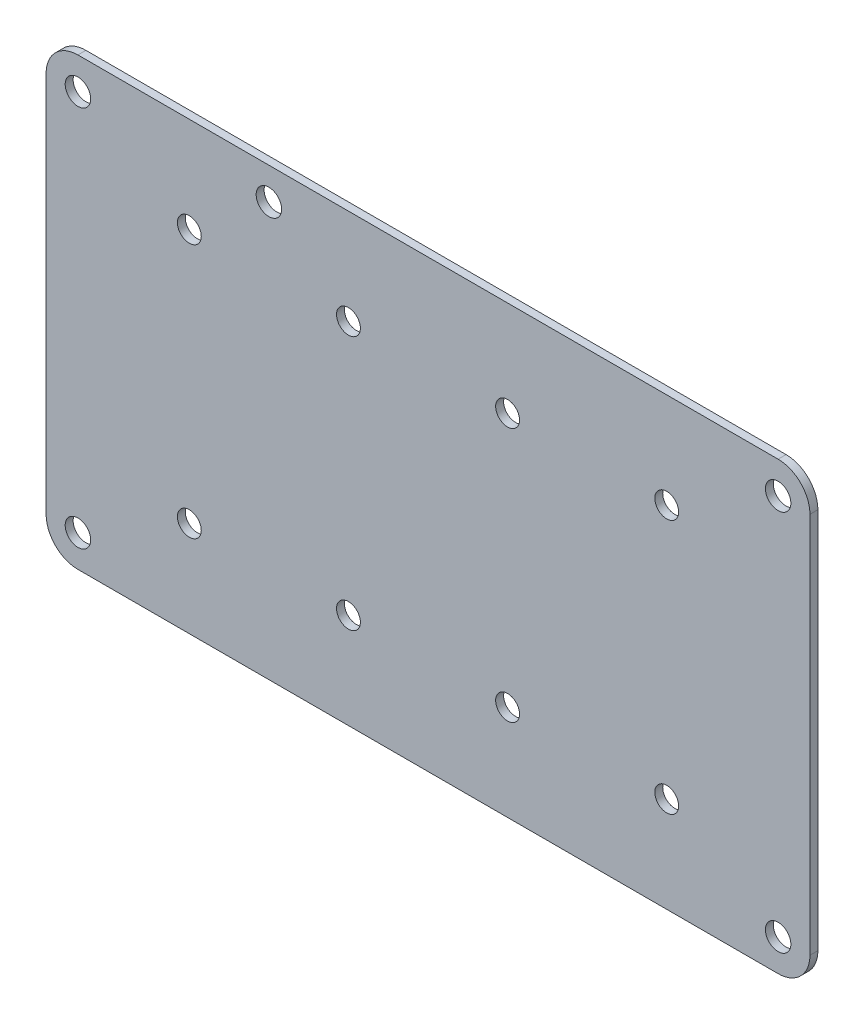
ISO-10303-21;
HEADER;
FILE_DESCRIPTION(('STEP AP214'),'2;1');
FILE_NAME('part.step','',(''),(''),'','','');
FILE_SCHEMA(('AUTOMOTIVE_DESIGN { 1 0 10303 214 1 1 1 1 }'));
ENDSEC;
DATA;
#1=APPLICATION_CONTEXT('core data for automotive mechanical design processes');
#2=APPLICATION_PROTOCOL_DEFINITION('international standard','automotive_design',2000,#1);
#3=PRODUCT_CONTEXT('',#1,'mechanical');
#4=PRODUCT('Part','Part','',(#3));
#5=PRODUCT_RELATED_PRODUCT_CATEGORY('part','',(#4));
#6=PRODUCT_DEFINITION_FORMATION('','',#4);
#7=PRODUCT_DEFINITION_CONTEXT('part definition',#1,'design');
#8=PRODUCT_DEFINITION('design','',#6,#7);
#9=PRODUCT_DEFINITION_SHAPE('','',#8);
#10=(LENGTH_UNIT() NAMED_UNIT(*) SI_UNIT(.MILLI.,.METRE.));
#11=(NAMED_UNIT(*) PLANE_ANGLE_UNIT() SI_UNIT($,.RADIAN.));
#12=(NAMED_UNIT(*) SI_UNIT($,.STERADIAN.) SOLID_ANGLE_UNIT());
#13=UNCERTAINTY_MEASURE_WITH_UNIT(LENGTH_MEASURE(1.E-05),#10,'distance_accuracy_value','');
#14=(GEOMETRIC_REPRESENTATION_CONTEXT(3) GLOBAL_UNCERTAINTY_ASSIGNED_CONTEXT((#13)) GLOBAL_UNIT_ASSIGNED_CONTEXT((#10,
#11,#12)) REPRESENTATION_CONTEXT('',''));
#15=CARTESIAN_POINT('',(0.,0.,0.));
#16=DIRECTION('',(0.,0.,1.));
#17=DIRECTION('',(1.,0.,0.));
#18=AXIS2_PLACEMENT_3D('',#15,#16,#17);
#19=CARTESIAN_POINT('',(-152.4,0.,1.5875));
#20=DIRECTION('',(1.,0.,0.));
#21=DIRECTION('',(0.,0.,-1.));
#22=AXIS2_PLACEMENT_3D('',#19,#20,#21);
#23=PLANE('',#22);
#24=DIRECTION('',(0.,-1.,0.));
#25=VECTOR('',#24,1.);
#26=CARTESIAN_POINT('',(-152.4,0.,1.5875));
#27=LINE('',#26,#25);
#28=CARTESIAN_POINT('',(-152.4,-6.35,1.5875));
#29=VERTEX_POINT('',#28);
#30=CARTESIAN_POINT('',(-152.4,-82.55,1.5875));
#31=VERTEX_POINT('',#30);
#32=EDGE_CURVE('E154',#29,#31,#27,.T.);
#33=ORIENTED_EDGE('',*,*,#32,.F.);
#34=DIRECTION('',(0.,0.,-1.));
#35=VECTOR('',#34,1.);
#36=CARTESIAN_POINT('',(-152.4,-6.35,0.));
#37=LINE('',#36,#35);
#38=CARTESIAN_POINT('',(-152.4,-6.35,0.));
#39=VERTEX_POINT('',#38);
#40=EDGE_CURVE('E150',#29,#39,#37,.T.);
#41=ORIENTED_EDGE('',*,*,#40,.T.);
#42=DIRECTION('',(0.,-1.,0.));
#43=VECTOR('',#42,1.);
#44=CARTESIAN_POINT('',(-152.4,0.,0.));
#45=LINE('',#44,#43);
#46=CARTESIAN_POINT('',(-152.4,-82.55,0.));
#47=VERTEX_POINT('',#46);
#48=EDGE_CURVE('E103',#39,#47,#45,.T.);
#49=ORIENTED_EDGE('',*,*,#48,.T.);
#50=DIRECTION('',(0.,0.,-1.));
#51=VECTOR('',#50,1.);
#52=CARTESIAN_POINT('',(-152.4,-82.55,1.5875));
#53=LINE('',#52,#51);
#54=EDGE_CURVE('E148',#47,#31,#53,.F.);
#55=ORIENTED_EDGE('',*,*,#54,.T.);
#56=EDGE_LOOP('',(#33,#41,#49,#55));
#57=FACE_BOUND('',#56,.T.);
#58=ADVANCED_FACE('F32',(#57),#23,.F.);
#59=CARTESIAN_POINT('',(-152.4,-88.9,1.5875));
#60=DIRECTION('',(0.,1.,0.));
#61=DIRECTION('',(-1.,0.,0.));
#62=AXIS2_PLACEMENT_3D('',#59,#60,#61);
#63=PLANE('',#62);
#64=DIRECTION('',(1.,0.,0.));
#65=VECTOR('',#64,1.);
#66=CARTESIAN_POINT('',(-152.4,-88.9,1.5875));
#67=LINE('',#66,#65);
#68=CARTESIAN_POINT('',(-146.05,-88.9,1.5875));
#69=VERTEX_POINT('',#68);
#70=CARTESIAN_POINT('',(-6.35000000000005,-88.9,1.5875));
#71=VERTEX_POINT('',#70);
#72=EDGE_CURVE('E130',#69,#71,#67,.T.);
#73=ORIENTED_EDGE('',*,*,#72,.F.);
#74=DIRECTION('',(0.,0.,-1.));
#75=VECTOR('',#74,1.);
#76=CARTESIAN_POINT('',(-146.05,-88.9,1.5875));
#77=LINE('',#76,#75);
#78=CARTESIAN_POINT('',(-146.05,-88.9,0.));
#79=VERTEX_POINT('',#78);
#80=EDGE_CURVE('E11',#69,#79,#77,.T.);
#81=ORIENTED_EDGE('',*,*,#80,.T.);
#82=DIRECTION('',(1.,0.,0.));
#83=VECTOR('',#82,1.);
#84=CARTESIAN_POINT('',(-152.4,-88.9,0.));
#85=LINE('',#84,#83);
#86=CARTESIAN_POINT('',(-6.35000000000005,-88.9,0.));
#87=VERTEX_POINT('',#86);
#88=EDGE_CURVE('E161',#79,#87,#85,.T.);
#89=ORIENTED_EDGE('',*,*,#88,.T.);
#90=DIRECTION('',(0.,0.,-1.));
#91=VECTOR('',#90,1.);
#92=CARTESIAN_POINT('',(-6.34999999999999,-88.9,1.5875));
#93=LINE('',#92,#91);
#94=EDGE_CURVE('E40',#87,#71,#93,.F.);
#95=ORIENTED_EDGE('',*,*,#94,.T.);
#96=EDGE_LOOP('',(#73,#81,#89,#95));
#97=FACE_BOUND('',#96,.T.);
#98=ADVANCED_FACE('F177',(#97),#63,.F.);
#99=CARTESIAN_POINT('',(0.,-88.9,1.5875));
#100=DIRECTION('',(-1.,0.,0.));
#101=DIRECTION('',(0.,0.,1.));
#102=AXIS2_PLACEMENT_3D('',#99,#100,#101);
#103=PLANE('',#102);
#104=DIRECTION('',(0.,1.,0.));
#105=VECTOR('',#104,1.);
#106=CARTESIAN_POINT('',(0.,-88.9,0.));
#107=LINE('',#106,#105);
#108=CARTESIAN_POINT('',(0.,-82.55,0.));
#109=VERTEX_POINT('',#108);
#110=CARTESIAN_POINT('',(0.,-6.34999999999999,0.));
#111=VERTEX_POINT('',#110);
#112=EDGE_CURVE('E120',#109,#111,#107,.T.);
#113=ORIENTED_EDGE('',*,*,#112,.T.);
#114=DIRECTION('',(0.,0.,-1.));
#115=VECTOR('',#114,1.);
#116=CARTESIAN_POINT('',(0.,-6.35,1.5875));
#117=LINE('',#116,#115);
#118=CARTESIAN_POINT('',(0.,-6.34999999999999,1.5875));
#119=VERTEX_POINT('',#118);
#120=EDGE_CURVE('E140',#111,#119,#117,.F.);
#121=ORIENTED_EDGE('',*,*,#120,.T.);
#122=DIRECTION('',(0.,1.,0.));
#123=VECTOR('',#122,1.);
#124=CARTESIAN_POINT('',(0.,-88.9,1.5875));
#125=LINE('',#124,#123);
#126=CARTESIAN_POINT('',(0.,-82.55,1.5875));
#127=VERTEX_POINT('',#126);
#128=EDGE_CURVE('E125',#127,#119,#125,.T.);
#129=ORIENTED_EDGE('',*,*,#128,.F.);
#130=DIRECTION('',(0.,0.,-1.));
#131=VECTOR('',#130,1.);
#132=CARTESIAN_POINT('',(0.,-82.55,1.5875));
#133=LINE('',#132,#131);
#134=EDGE_CURVE('E137',#127,#109,#133,.T.);
#135=ORIENTED_EDGE('',*,*,#134,.T.);
#136=EDGE_LOOP('',(#113,#121,#129,#135));
#137=FACE_BOUND('',#136,.T.);
#138=ADVANCED_FACE('F167',(#137),#103,.F.);
#139=CARTESIAN_POINT('',(-94.6983341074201,0.,1.5875));
#140=DIRECTION('',(0.,1.,0.));
#141=DIRECTION('',(0.,0.,1.));
#142=AXIS2_PLACEMENT_3D('',#139,#140,#141);
#143=PLANE('',#142);
#144=DIRECTION('',(-1.,0.,0.));
#145=VECTOR('',#144,1.);
#146=CARTESIAN_POINT('',(-94.6983341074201,0.,1.5875));
#147=LINE('',#146,#145);
#148=CARTESIAN_POINT('',(-6.35000000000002,0.,1.5875));
#149=VERTEX_POINT('',#148);
#150=CARTESIAN_POINT('',(-146.05,0.,1.5875));
#151=VERTEX_POINT('',#150);
#152=EDGE_CURVE('E119',#149,#151,#147,.T.);
#153=ORIENTED_EDGE('',*,*,#152,.F.);
#154=DIRECTION('',(0.,0.,-1.));
#155=VECTOR('',#154,1.);
#156=CARTESIAN_POINT('',(-6.34999999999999,0.,0.));
#157=LINE('',#156,#155);
#158=CARTESIAN_POINT('',(-6.34999999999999,0.,0.));
#159=VERTEX_POINT('',#158);
#160=EDGE_CURVE('E118',#149,#159,#157,.T.);
#161=ORIENTED_EDGE('',*,*,#160,.T.);
#162=DIRECTION('',(1.,0.,0.));
#163=VECTOR('',#162,1.);
#164=CARTESIAN_POINT('',(-94.6983341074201,0.,0.));
#165=LINE('',#164,#163);
#166=CARTESIAN_POINT('',(-146.05,0.,0.));
#167=VERTEX_POINT('',#166);
#168=EDGE_CURVE('E101',#167,#159,#165,.T.);
#169=ORIENTED_EDGE('',*,*,#168,.F.);
#170=DIRECTION('',(0.,0.,-1.));
#171=VECTOR('',#170,1.);
#172=CARTESIAN_POINT('',(-146.05,0.,1.5875));
#173=LINE('',#172,#171);
#174=EDGE_CURVE('E115',#167,#151,#173,.F.);
#175=ORIENTED_EDGE('',*,*,#174,.T.);
#176=EDGE_LOOP('',(#153,#161,#169,#175));
#177=FACE_BOUND('',#176,.T.);
#178=ADVANCED_FACE('F114',(#177),#143,.T.);
#179=CARTESIAN_POINT('',(0.,0.,1.5875));
#180=DIRECTION('',(0.,0.,1.));
#181=DIRECTION('',(1.,0.,0.));
#182=AXIS2_PLACEMENT_3D('',#179,#180,#181);
#183=PLANE('',#182);
#184=CARTESIAN_POINT('',(-28.5749999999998,-19.0500000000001,1.5875));
#185=DIRECTION('',(0.,0.,1.));
#186=DIRECTION('',(1.,0.,0.));
#187=AXIS2_PLACEMENT_3D('',#184,#185,#186);
#188=CIRCLE('',#187,2.38125);
#189=CARTESIAN_POINT('',(-26.1937499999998,-19.0500000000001,1.5875));
#190=VERTEX_POINT('',#189);
#191=EDGE_CURVE('E398',#190,#190,#188,.T.);
#192=ORIENTED_EDGE('',*,*,#191,.F.);
#193=EDGE_LOOP('',(#192));
#194=FACE_BOUND('',#193,.T.);
#195=CARTESIAN_POINT('',(-60.3249999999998,-19.0500000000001,1.5875));
#196=DIRECTION('',(0.,0.,1.));
#197=DIRECTION('',(1.,0.,0.));
#198=AXIS2_PLACEMENT_3D('',#195,#196,#197);
#199=CIRCLE('',#198,2.38125);
#200=CARTESIAN_POINT('',(-57.9437499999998,-19.0500000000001,1.5875));
#201=VERTEX_POINT('',#200);
#202=EDGE_CURVE('E408',#201,#201,#199,.T.);
#203=ORIENTED_EDGE('',*,*,#202,.F.);
#204=EDGE_LOOP('',(#203));
#205=FACE_BOUND('',#204,.T.);
#206=CARTESIAN_POINT('',(-92.0749999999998,-19.05,1.5875));
#207=DIRECTION('',(0.,0.,1.));
#208=DIRECTION('',(1.,0.,0.));
#209=AXIS2_PLACEMENT_3D('',#206,#207,#208);
#210=CIRCLE('',#209,2.38125);
#211=CARTESIAN_POINT('',(-89.6937499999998,-19.05,1.5875));
#212=VERTEX_POINT('',#211);
#213=EDGE_CURVE('E414',#212,#212,#210,.T.);
#214=ORIENTED_EDGE('',*,*,#213,.F.);
#215=EDGE_LOOP('',(#214));
#216=FACE_BOUND('',#215,.T.);
#217=CARTESIAN_POINT('',(-123.825,-19.05,1.5875));
#218=DIRECTION('',(0.,0.,1.));
#219=DIRECTION('',(1.,0.,0.));
#220=AXIS2_PLACEMENT_3D('',#217,#218,#219);
#221=CIRCLE('',#220,2.38125000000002);
#222=CARTESIAN_POINT('',(-121.44375,-19.05,1.5875));
#223=VERTEX_POINT('',#222);
#224=EDGE_CURVE('E420',#223,#223,#221,.T.);
#225=ORIENTED_EDGE('',*,*,#224,.F.);
#226=EDGE_LOOP('',(#225));
#227=FACE_BOUND('',#226,.T.);
#228=CARTESIAN_POINT('',(-28.575,-69.8500000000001,1.5875));
#229=DIRECTION('',(0.,0.,1.));
#230=DIRECTION('',(1.,0.,0.));
#231=AXIS2_PLACEMENT_3D('',#228,#229,#230);
#232=CIRCLE('',#231,2.38125);
#233=CARTESIAN_POINT('',(-26.19375,-69.8500000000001,1.5875));
#234=VERTEX_POINT('',#233);
#235=EDGE_CURVE('E426',#234,#234,#232,.T.);
#236=ORIENTED_EDGE('',*,*,#235,.F.);
#237=EDGE_LOOP('',(#236));
#238=FACE_BOUND('',#237,.T.);
#239=CARTESIAN_POINT('',(-60.325,-69.8500000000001,1.5875));
#240=DIRECTION('',(0.,0.,1.));
#241=DIRECTION('',(1.,0.,0.));
#242=AXIS2_PLACEMENT_3D('',#239,#240,#241);
#243=CIRCLE('',#242,2.38125);
#244=CARTESIAN_POINT('',(-57.94375,-69.8500000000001,1.5875));
#245=VERTEX_POINT('',#244);
#246=EDGE_CURVE('E432',#245,#245,#243,.T.);
#247=ORIENTED_EDGE('',*,*,#246,.F.);
#248=EDGE_LOOP('',(#247));
#249=FACE_BOUND('',#248,.T.);
#250=CARTESIAN_POINT('',(-92.075,-69.85,1.5875));
#251=DIRECTION('',(0.,0.,1.));
#252=DIRECTION('',(1.,0.,0.));
#253=AXIS2_PLACEMENT_3D('',#250,#251,#252);
#254=CIRCLE('',#253,2.38125);
#255=CARTESIAN_POINT('',(-89.69375,-69.85,1.5875));
#256=VERTEX_POINT('',#255);
#257=EDGE_CURVE('E438',#256,#256,#254,.T.);
#258=ORIENTED_EDGE('',*,*,#257,.F.);
#259=EDGE_LOOP('',(#258));
#260=FACE_BOUND('',#259,.T.);
#261=CARTESIAN_POINT('',(-123.825,-69.85,1.5875));
#262=DIRECTION('',(0.,0.,1.));
#263=DIRECTION('',(1.,0.,0.));
#264=AXIS2_PLACEMENT_3D('',#261,#262,#263);
#265=CIRCLE('',#264,2.38125);
#266=CARTESIAN_POINT('',(-121.44375,-69.85,1.5875));
#267=VERTEX_POINT('',#266);
#268=EDGE_CURVE('E444',#267,#267,#265,.T.);
#269=ORIENTED_EDGE('',*,*,#268,.F.);
#270=EDGE_LOOP('',(#269));
#271=FACE_BOUND('',#270,.T.);
#272=CARTESIAN_POINT('',(-6.35000000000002,-6.35,1.5875));
#273=DIRECTION('',(0.,0.,1.));
#274=DIRECTION('',(1.,0.,0.));
#275=AXIS2_PLACEMENT_3D('',#272,#273,#274);
#276=CIRCLE('',#275,2.54);
#277=CARTESIAN_POINT('',(-3.81000000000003,-6.35,1.5875));
#278=VERTEX_POINT('',#277);
#279=EDGE_CURVE('E447',#278,#278,#276,.T.);
#280=ORIENTED_EDGE('',*,*,#279,.F.);
#281=EDGE_LOOP('',(#280));
#282=FACE_BOUND('',#281,.T.);
#283=CARTESIAN_POINT('',(-146.05,-6.35000000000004,1.5875));
#284=DIRECTION('',(0.,0.,1.));
#285=DIRECTION('',(1.,0.,0.));
#286=AXIS2_PLACEMENT_3D('',#283,#284,#285);
#287=CIRCLE('',#286,2.53999999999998);
#288=CARTESIAN_POINT('',(-143.51,-6.35000000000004,1.5875));
#289=VERTEX_POINT('',#288);
#290=EDGE_CURVE('E451',#289,#289,#287,.T.);
#291=ORIENTED_EDGE('',*,*,#290,.F.);
#292=EDGE_LOOP('',(#291));
#293=FACE_BOUND('',#292,.T.);
#294=CARTESIAN_POINT('',(-6.34999999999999,-82.55,1.5875));
#295=DIRECTION('',(0.,0.,1.));
#296=DIRECTION('',(1.,0.,0.));
#297=AXIS2_PLACEMENT_3D('',#294,#295,#296);
#298=CIRCLE('',#297,2.54);
#299=CARTESIAN_POINT('',(-3.81,-82.55,1.5875));
#300=VERTEX_POINT('',#299);
#301=EDGE_CURVE('E456',#300,#300,#298,.T.);
#302=ORIENTED_EDGE('',*,*,#301,.F.);
#303=EDGE_LOOP('',(#302));
#304=FACE_BOUND('',#303,.T.);
#305=CARTESIAN_POINT('',(-146.05,-82.55,1.5875));
#306=DIRECTION('',(0.,0.,1.));
#307=DIRECTION('',(1.,0.,0.));
#308=AXIS2_PLACEMENT_3D('',#305,#306,#307);
#309=CIRCLE('',#308,2.53999999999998);
#310=CARTESIAN_POINT('',(-143.51,-82.55,1.5875));
#311=VERTEX_POINT('',#310);
#312=EDGE_CURVE('E462',#311,#311,#309,.T.);
#313=ORIENTED_EDGE('',*,*,#312,.F.);
#314=EDGE_LOOP('',(#313));
#315=FACE_BOUND('',#314,.T.);
#316=CARTESIAN_POINT('',(-107.95,-6.35000000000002,1.5875));
#317=DIRECTION('',(0.,0.,1.));
#318=DIRECTION('',(1.,0.,0.));
#319=AXIS2_PLACEMENT_3D('',#316,#317,#318);
#320=CIRCLE('',#319,2.54);
#321=CARTESIAN_POINT('',(-105.41,-6.35000000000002,1.5875));
#322=VERTEX_POINT('',#321);
#323=EDGE_CURVE('E162',#322,#322,#320,.T.);
#324=ORIENTED_EDGE('',*,*,#323,.F.);
#325=EDGE_LOOP('',(#324));
#326=FACE_BOUND('',#325,.T.);
#327=ORIENTED_EDGE('',*,*,#128,.T.);
#328=CARTESIAN_POINT('',(-6.34999999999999,-6.35,1.5875));
#329=DIRECTION('',(0.,0.,1.));
#330=DIRECTION('',(1.,0.,0.));
#331=AXIS2_PLACEMENT_3D('',#328,#329,#330);
#332=CIRCLE('',#331,6.35);
#333=EDGE_CURVE('E146',#119,#149,#332,.T.);
#334=ORIENTED_EDGE('',*,*,#333,.T.);
#335=ORIENTED_EDGE('',*,*,#152,.T.);
#336=CARTESIAN_POINT('',(-146.05,-6.35,1.5875));
#337=DIRECTION('',(0.,0.,1.));
#338=DIRECTION('',(1.,0.,0.));
#339=AXIS2_PLACEMENT_3D('',#336,#337,#338);
#340=CIRCLE('',#339,6.35);
#341=EDGE_CURVE('E124',#151,#29,#340,.T.);
#342=ORIENTED_EDGE('',*,*,#341,.T.);
#343=ORIENTED_EDGE('',*,*,#32,.T.);
#344=CARTESIAN_POINT('',(-146.05,-82.55,1.5875));
#345=DIRECTION('',(0.,0.,1.));
#346=DIRECTION('',(1.,0.,0.));
#347=AXIS2_PLACEMENT_3D('',#344,#345,#346);
#348=CIRCLE('',#347,6.35);
#349=EDGE_CURVE('E53',#31,#69,#348,.T.);
#350=ORIENTED_EDGE('',*,*,#349,.T.);
#351=ORIENTED_EDGE('',*,*,#72,.T.);
#352=CARTESIAN_POINT('',(-6.35,-82.55,1.5875));
#353=DIRECTION('',(0.,0.,1.));
#354=DIRECTION('',(1.,0.,0.));
#355=AXIS2_PLACEMENT_3D('',#352,#353,#354);
#356=CIRCLE('',#355,6.35);
#357=EDGE_CURVE('E142',#71,#127,#356,.T.);
#358=ORIENTED_EDGE('',*,*,#357,.T.);
#359=EDGE_LOOP('',(#327,#334,#335,#342,#343,#350,#351,#358));
#360=FACE_BOUND('',#359,.T.);
#361=ADVANCED_FACE('F173',(#194,#205,#216,#227,#238,#249,#260,#271,#282,#293,#304,#315,#326,
#360),#183,.T.);
#362=CARTESIAN_POINT('',(0.,0.,0.));
#363=DIRECTION('',(0.,0.,1.));
#364=DIRECTION('',(1.,0.,0.));
#365=AXIS2_PLACEMENT_3D('',#362,#363,#364);
#366=PLANE('',#365);
#367=CARTESIAN_POINT('',(-28.5749999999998,-19.0500000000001,0.));
#368=DIRECTION('',(0.,0.,-1.));
#369=DIRECTION('',(-1.,0.,0.));
#370=AXIS2_PLACEMENT_3D('',#367,#368,#369);
#371=CIRCLE('',#370,2.38125);
#372=CARTESIAN_POINT('',(-30.9562499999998,-19.0500000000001,0.));
#373=VERTEX_POINT('',#372);
#374=EDGE_CURVE('E401',#373,#373,#371,.T.);
#375=ORIENTED_EDGE('',*,*,#374,.F.);
#376=EDGE_LOOP('',(#375));
#377=FACE_BOUND('',#376,.T.);
#378=CARTESIAN_POINT('',(-60.3249999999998,-19.0500000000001,0.));
#379=DIRECTION('',(0.,0.,-1.));
#380=DIRECTION('',(-1.,0.,0.));
#381=AXIS2_PLACEMENT_3D('',#378,#379,#380);
#382=CIRCLE('',#381,2.38125);
#383=CARTESIAN_POINT('',(-62.7062499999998,-19.0500000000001,0.));
#384=VERTEX_POINT('',#383);
#385=EDGE_CURVE('E403',#384,#384,#382,.T.);
#386=ORIENTED_EDGE('',*,*,#385,.F.);
#387=EDGE_LOOP('',(#386));
#388=FACE_BOUND('',#387,.T.);
#389=CARTESIAN_POINT('',(-92.0749999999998,-19.05,0.));
#390=DIRECTION('',(0.,0.,-1.));
#391=DIRECTION('',(-1.,0.,0.));
#392=AXIS2_PLACEMENT_3D('',#389,#390,#391);
#393=CIRCLE('',#392,2.38125);
#394=CARTESIAN_POINT('',(-94.4562499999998,-19.05,0.));
#395=VERTEX_POINT('',#394);
#396=EDGE_CURVE('E411',#395,#395,#393,.T.);
#397=ORIENTED_EDGE('',*,*,#396,.F.);
#398=EDGE_LOOP('',(#397));
#399=FACE_BOUND('',#398,.T.);
#400=CARTESIAN_POINT('',(-123.825,-19.05,0.));
#401=DIRECTION('',(0.,0.,-1.));
#402=DIRECTION('',(-1.,0.,0.));
#403=AXIS2_PLACEMENT_3D('',#400,#401,#402);
#404=CIRCLE('',#403,2.38125000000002);
#405=CARTESIAN_POINT('',(-126.20625,-19.05,0.));
#406=VERTEX_POINT('',#405);
#407=EDGE_CURVE('E417',#406,#406,#404,.T.);
#408=ORIENTED_EDGE('',*,*,#407,.F.);
#409=EDGE_LOOP('',(#408));
#410=FACE_BOUND('',#409,.T.);
#411=CARTESIAN_POINT('',(-28.575,-69.8500000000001,0.));
#412=DIRECTION('',(0.,0.,-1.));
#413=DIRECTION('',(-1.,0.,0.));
#414=AXIS2_PLACEMENT_3D('',#411,#412,#413);
#415=CIRCLE('',#414,2.38125);
#416=CARTESIAN_POINT('',(-30.95625,-69.8500000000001,0.));
#417=VERTEX_POINT('',#416);
#418=EDGE_CURVE('E423',#417,#417,#415,.T.);
#419=ORIENTED_EDGE('',*,*,#418,.F.);
#420=EDGE_LOOP('',(#419));
#421=FACE_BOUND('',#420,.T.);
#422=CARTESIAN_POINT('',(-60.325,-69.8500000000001,0.));
#423=DIRECTION('',(0.,0.,-1.));
#424=DIRECTION('',(-1.,0.,0.));
#425=AXIS2_PLACEMENT_3D('',#422,#423,#424);
#426=CIRCLE('',#425,2.38125);
#427=CARTESIAN_POINT('',(-62.70625,-69.8500000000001,0.));
#428=VERTEX_POINT('',#427);
#429=EDGE_CURVE('E429',#428,#428,#426,.T.);
#430=ORIENTED_EDGE('',*,*,#429,.F.);
#431=EDGE_LOOP('',(#430));
#432=FACE_BOUND('',#431,.T.);
#433=CARTESIAN_POINT('',(-92.075,-69.85,0.));
#434=DIRECTION('',(0.,0.,-1.));
#435=DIRECTION('',(-1.,0.,0.));
#436=AXIS2_PLACEMENT_3D('',#433,#434,#435);
#437=CIRCLE('',#436,2.38125);
#438=CARTESIAN_POINT('',(-94.45625,-69.85,0.));
#439=VERTEX_POINT('',#438);
#440=EDGE_CURVE('E435',#439,#439,#437,.T.);
#441=ORIENTED_EDGE('',*,*,#440,.F.);
#442=EDGE_LOOP('',(#441));
#443=FACE_BOUND('',#442,.T.);
#444=CARTESIAN_POINT('',(-123.825,-69.85,0.));
#445=DIRECTION('',(0.,0.,-1.));
#446=DIRECTION('',(-1.,0.,0.));
#447=AXIS2_PLACEMENT_3D('',#444,#445,#446);
#448=CIRCLE('',#447,2.38125);
#449=CARTESIAN_POINT('',(-126.20625,-69.85,0.));
#450=VERTEX_POINT('',#449);
#451=EDGE_CURVE('E441',#450,#450,#448,.T.);
#452=ORIENTED_EDGE('',*,*,#451,.F.);
#453=EDGE_LOOP('',(#452));
#454=FACE_BOUND('',#453,.T.);
#455=CARTESIAN_POINT('',(-6.35000000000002,-6.35,0.));
#456=DIRECTION('',(0.,0.,1.));
#457=DIRECTION('',(1.,0.,0.));
#458=AXIS2_PLACEMENT_3D('',#455,#456,#457);
#459=CIRCLE('',#458,2.54);
#460=CARTESIAN_POINT('',(-3.81000000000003,-6.35,0.));
#461=VERTEX_POINT('',#460);
#462=EDGE_CURVE('E448',#461,#461,#459,.T.);
#463=ORIENTED_EDGE('',*,*,#462,.T.);
#464=EDGE_LOOP('',(#463));
#465=FACE_BOUND('',#464,.T.);
#466=CARTESIAN_POINT('',(-146.05,-6.35000000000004,0.));
#467=DIRECTION('',(0.,0.,1.));
#468=DIRECTION('',(1.,0.,0.));
#469=AXIS2_PLACEMENT_3D('',#466,#467,#468);
#470=CIRCLE('',#469,2.53999999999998);
#471=CARTESIAN_POINT('',(-143.51,-6.35000000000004,0.));
#472=VERTEX_POINT('',#471);
#473=EDGE_CURVE('E453',#472,#472,#470,.T.);
#474=ORIENTED_EDGE('',*,*,#473,.T.);
#475=EDGE_LOOP('',(#474));
#476=FACE_BOUND('',#475,.T.);
#477=CARTESIAN_POINT('',(-6.34999999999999,-82.55,0.));
#478=DIRECTION('',(0.,0.,1.));
#479=DIRECTION('',(1.,0.,0.));
#480=AXIS2_PLACEMENT_3D('',#477,#478,#479);
#481=CIRCLE('',#480,2.54);
#482=CARTESIAN_POINT('',(-3.81,-82.55,0.));
#483=VERTEX_POINT('',#482);
#484=EDGE_CURVE('E459',#483,#483,#481,.T.);
#485=ORIENTED_EDGE('',*,*,#484,.T.);
#486=EDGE_LOOP('',(#485));
#487=FACE_BOUND('',#486,.T.);
#488=CARTESIAN_POINT('',(-146.05,-82.55,0.));
#489=DIRECTION('',(0.,0.,1.));
#490=DIRECTION('',(1.,0.,0.));
#491=AXIS2_PLACEMENT_3D('',#488,#489,#490);
#492=CIRCLE('',#491,2.53999999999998);
#493=CARTESIAN_POINT('',(-143.51,-82.55,0.));
#494=VERTEX_POINT('',#493);
#495=EDGE_CURVE('E465',#494,#494,#492,.T.);
#496=ORIENTED_EDGE('',*,*,#495,.T.);
#497=EDGE_LOOP('',(#496));
#498=FACE_BOUND('',#497,.T.);
#499=CARTESIAN_POINT('',(-107.95,-6.35000000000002,0.));
#500=DIRECTION('',(0.,0.,1.));
#501=DIRECTION('',(1.,0.,0.));
#502=AXIS2_PLACEMENT_3D('',#499,#500,#501);
#503=CIRCLE('',#502,2.54);
#504=CARTESIAN_POINT('',(-105.41,-6.35000000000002,0.));
#505=VERTEX_POINT('',#504);
#506=EDGE_CURVE('E468',#505,#505,#503,.T.);
#507=ORIENTED_EDGE('',*,*,#506,.T.);
#508=EDGE_LOOP('',(#507));
#509=FACE_BOUND('',#508,.T.);
#510=ORIENTED_EDGE('',*,*,#168,.T.);
#511=CARTESIAN_POINT('',(-6.34999999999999,-6.35,0.));
#512=DIRECTION('',(0.,0.,1.));
#513=DIRECTION('',(1.,0.,0.));
#514=AXIS2_PLACEMENT_3D('',#511,#512,#513);
#515=CIRCLE('',#514,6.35);
#516=EDGE_CURVE('E108',#159,#111,#515,.F.);
#517=ORIENTED_EDGE('',*,*,#516,.T.);
#518=ORIENTED_EDGE('',*,*,#112,.F.);
#519=CARTESIAN_POINT('',(-6.35,-82.55,0.));
#520=DIRECTION('',(0.,0.,1.));
#521=DIRECTION('',(1.,0.,0.));
#522=AXIS2_PLACEMENT_3D('',#519,#520,#521);
#523=CIRCLE('',#522,6.35);
#524=EDGE_CURVE('E127',#109,#87,#523,.F.);
#525=ORIENTED_EDGE('',*,*,#524,.T.);
#526=ORIENTED_EDGE('',*,*,#88,.F.);
#527=CARTESIAN_POINT('',(-146.05,-82.55,0.));
#528=DIRECTION('',(0.,0.,1.));
#529=DIRECTION('',(1.,0.,0.));
#530=AXIS2_PLACEMENT_3D('',#527,#528,#529);
#531=CIRCLE('',#530,6.35);
#532=EDGE_CURVE('E109',#79,#47,#531,.F.);
#533=ORIENTED_EDGE('',*,*,#532,.T.);
#534=ORIENTED_EDGE('',*,*,#48,.F.);
#535=CARTESIAN_POINT('',(-146.05,-6.35,0.));
#536=DIRECTION('',(0.,0.,1.));
#537=DIRECTION('',(1.,0.,0.));
#538=AXIS2_PLACEMENT_3D('',#535,#536,#537);
#539=CIRCLE('',#538,6.35);
#540=EDGE_CURVE('E98',#39,#167,#539,.F.);
#541=ORIENTED_EDGE('',*,*,#540,.T.);
#542=EDGE_LOOP('',(#510,#517,#518,#525,#526,#533,#534,#541));
#543=FACE_BOUND('',#542,.T.);
#544=ADVANCED_FACE('F100',(#377,#388,#399,#410,#421,#432,#443,#454,#465,#476,#487,#498,#509,
#543),#366,.F.);
#545=CARTESIAN_POINT('',(-107.95,-6.35000000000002,1.5875));
#546=DIRECTION('',(0.,0.,-1.));
#547=DIRECTION('',(-1.,0.,0.));
#548=AXIS2_PLACEMENT_3D('',#545,#546,#547);
#549=CYLINDRICAL_SURFACE('',#548,2.54);
#550=ORIENTED_EDGE('',*,*,#323,.T.);
#551=EDGE_LOOP('',(#550));
#552=FACE_BOUND('',#551,.T.);
#553=ORIENTED_EDGE('',*,*,#506,.F.);
#554=EDGE_LOOP('',(#553));
#555=FACE_BOUND('',#554,.T.);
#556=ADVANCED_FACE('F221',(#552,#555),#549,.F.);
#557=CARTESIAN_POINT('',(-146.05,-82.55,1.5875));
#558=DIRECTION('',(0.,0.,-1.));
#559=DIRECTION('',(-1.,0.,0.));
#560=AXIS2_PLACEMENT_3D('',#557,#558,#559);
#561=CYLINDRICAL_SURFACE('',#560,2.53999999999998);
#562=ORIENTED_EDGE('',*,*,#312,.T.);
#563=EDGE_LOOP('',(#562));
#564=FACE_BOUND('',#563,.T.);
#565=ORIENTED_EDGE('',*,*,#495,.F.);
#566=EDGE_LOOP('',(#565));
#567=FACE_BOUND('',#566,.T.);
#568=ADVANCED_FACE('F217',(#564,#567),#561,.F.);
#569=CARTESIAN_POINT('',(-6.34999999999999,-82.55,1.5875));
#570=DIRECTION('',(0.,0.,-1.));
#571=DIRECTION('',(-1.,0.,0.));
#572=AXIS2_PLACEMENT_3D('',#569,#570,#571);
#573=CYLINDRICAL_SURFACE('',#572,2.54);
#574=ORIENTED_EDGE('',*,*,#301,.T.);
#575=EDGE_LOOP('',(#574));
#576=FACE_BOUND('',#575,.T.);
#577=ORIENTED_EDGE('',*,*,#484,.F.);
#578=EDGE_LOOP('',(#577));
#579=FACE_BOUND('',#578,.T.);
#580=ADVANCED_FACE('F207',(#576,#579),#573,.F.);
#581=CARTESIAN_POINT('',(-146.05,-6.35000000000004,1.5875));
#582=DIRECTION('',(0.,0.,-1.));
#583=DIRECTION('',(-1.,0.,0.));
#584=AXIS2_PLACEMENT_3D('',#581,#582,#583);
#585=CYLINDRICAL_SURFACE('',#584,2.53999999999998);
#586=ORIENTED_EDGE('',*,*,#290,.T.);
#587=EDGE_LOOP('',(#586));
#588=FACE_BOUND('',#587,.T.);
#589=ORIENTED_EDGE('',*,*,#473,.F.);
#590=EDGE_LOOP('',(#589));
#591=FACE_BOUND('',#590,.T.);
#592=ADVANCED_FACE('F201',(#588,#591),#585,.F.);
#593=CARTESIAN_POINT('',(-6.35000000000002,-6.35,1.5875));
#594=DIRECTION('',(0.,0.,-1.));
#595=DIRECTION('',(-1.,0.,0.));
#596=AXIS2_PLACEMENT_3D('',#593,#594,#595);
#597=CYLINDRICAL_SURFACE('',#596,2.54);
#598=ORIENTED_EDGE('',*,*,#279,.T.);
#599=EDGE_LOOP('',(#598));
#600=FACE_BOUND('',#599,.T.);
#601=ORIENTED_EDGE('',*,*,#462,.F.);
#602=EDGE_LOOP('',(#601));
#603=FACE_BOUND('',#602,.T.);
#604=ADVANCED_FACE('F197',(#600,#603),#597,.F.);
#605=CARTESIAN_POINT('',(-6.34999999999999,-6.35,1.5875));
#606=DIRECTION('',(0.,0.,1.));
#607=DIRECTION('',(1.,0.,0.));
#608=AXIS2_PLACEMENT_3D('',#605,#606,#607);
#609=CYLINDRICAL_SURFACE('',#608,6.35);
#610=ORIENTED_EDGE('',*,*,#333,.F.);
#611=ORIENTED_EDGE('',*,*,#120,.F.);
#612=ORIENTED_EDGE('',*,*,#516,.F.);
#613=ORIENTED_EDGE('',*,*,#160,.F.);
#614=EDGE_LOOP('',(#610,#611,#612,#613));
#615=FACE_BOUND('',#614,.T.);
#616=ADVANCED_FACE('F172',(#615),#609,.T.);
#617=CARTESIAN_POINT('',(-146.05,-6.35,1.5875));
#618=DIRECTION('',(0.,0.,1.));
#619=DIRECTION('',(1.,0.,0.));
#620=AXIS2_PLACEMENT_3D('',#617,#618,#619);
#621=CYLINDRICAL_SURFACE('',#620,6.35);
#622=ORIENTED_EDGE('',*,*,#341,.F.);
#623=ORIENTED_EDGE('',*,*,#174,.F.);
#624=ORIENTED_EDGE('',*,*,#540,.F.);
#625=ORIENTED_EDGE('',*,*,#40,.F.);
#626=EDGE_LOOP('',(#622,#623,#624,#625));
#627=FACE_BOUND('',#626,.T.);
#628=ADVANCED_FACE('F123',(#627),#621,.T.);
#629=CARTESIAN_POINT('',(-146.05,-82.55,1.5875));
#630=DIRECTION('',(0.,0.,-1.));
#631=DIRECTION('',(-1.,0.,0.));
#632=AXIS2_PLACEMENT_3D('',#629,#630,#631);
#633=CYLINDRICAL_SURFACE('',#632,6.35);
#634=ORIENTED_EDGE('',*,*,#349,.F.);
#635=ORIENTED_EDGE('',*,*,#54,.F.);
#636=ORIENTED_EDGE('',*,*,#532,.F.);
#637=ORIENTED_EDGE('',*,*,#80,.F.);
#638=EDGE_LOOP('',(#634,#635,#636,#637));
#639=FACE_BOUND('',#638,.T.);
#640=ADVANCED_FACE('F180',(#639),#633,.T.);
#641=CARTESIAN_POINT('',(-6.35,-82.55,1.5875));
#642=DIRECTION('',(0.,0.,-1.));
#643=DIRECTION('',(-1.,0.,0.));
#644=AXIS2_PLACEMENT_3D('',#641,#642,#643);
#645=CYLINDRICAL_SURFACE('',#644,6.35);
#646=ORIENTED_EDGE('',*,*,#357,.F.);
#647=ORIENTED_EDGE('',*,*,#94,.F.);
#648=ORIENTED_EDGE('',*,*,#524,.F.);
#649=ORIENTED_EDGE('',*,*,#134,.F.);
#650=EDGE_LOOP('',(#646,#647,#648,#649));
#651=FACE_BOUND('',#650,.T.);
#652=ADVANCED_FACE('F34',(#651),#645,.T.);
#653=CARTESIAN_POINT('',(-123.825,-69.85,3.175));
#654=DIRECTION('',(0.,0.,-1.));
#655=DIRECTION('',(-1.,0.,0.));
#656=AXIS2_PLACEMENT_3D('',#653,#654,#655);
#657=CYLINDRICAL_SURFACE('',#656,2.38125);
#658=ORIENTED_EDGE('',*,*,#268,.T.);
#659=EDGE_LOOP('',(#658));
#660=FACE_BOUND('',#659,.T.);
#661=ORIENTED_EDGE('',*,*,#451,.T.);
#662=EDGE_LOOP('',(#661));
#663=FACE_BOUND('',#662,.T.);
#664=ADVANCED_FACE('F186',(#660,#663),#657,.F.);
#665=CARTESIAN_POINT('',(-92.075,-69.85,3.175));
#666=DIRECTION('',(0.,0.,-1.));
#667=DIRECTION('',(-1.,0.,0.));
#668=AXIS2_PLACEMENT_3D('',#665,#666,#667);
#669=CYLINDRICAL_SURFACE('',#668,2.38125);
#670=ORIENTED_EDGE('',*,*,#257,.T.);
#671=EDGE_LOOP('',(#670));
#672=FACE_BOUND('',#671,.T.);
#673=ORIENTED_EDGE('',*,*,#440,.T.);
#674=EDGE_LOOP('',(#673));
#675=FACE_BOUND('',#674,.T.);
#676=ADVANCED_FACE('F323',(#672,#675),#669,.F.);
#677=CARTESIAN_POINT('',(-60.325,-69.8500000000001,3.175));
#678=DIRECTION('',(0.,0.,-1.));
#679=DIRECTION('',(-1.,0.,0.));
#680=AXIS2_PLACEMENT_3D('',#677,#678,#679);
#681=CYLINDRICAL_SURFACE('',#680,2.38125);
#682=ORIENTED_EDGE('',*,*,#246,.T.);
#683=EDGE_LOOP('',(#682));
#684=FACE_BOUND('',#683,.T.);
#685=ORIENTED_EDGE('',*,*,#429,.T.);
#686=EDGE_LOOP('',(#685));
#687=FACE_BOUND('',#686,.T.);
#688=ADVANCED_FACE('F331',(#684,#687),#681,.F.);
#689=CARTESIAN_POINT('',(-28.575,-69.8500000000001,3.175));
#690=DIRECTION('',(0.,0.,-1.));
#691=DIRECTION('',(-1.,0.,0.));
#692=AXIS2_PLACEMENT_3D('',#689,#690,#691);
#693=CYLINDRICAL_SURFACE('',#692,2.38125);
#694=ORIENTED_EDGE('',*,*,#235,.T.);
#695=EDGE_LOOP('',(#694));
#696=FACE_BOUND('',#695,.T.);
#697=ORIENTED_EDGE('',*,*,#418,.T.);
#698=EDGE_LOOP('',(#697));
#699=FACE_BOUND('',#698,.T.);
#700=ADVANCED_FACE('F339',(#696,#699),#693,.F.);
#701=CARTESIAN_POINT('',(-123.825,-19.05,3.175));
#702=DIRECTION('',(0.,0.,-1.));
#703=DIRECTION('',(-1.,0.,0.));
#704=AXIS2_PLACEMENT_3D('',#701,#702,#703);
#705=CYLINDRICAL_SURFACE('',#704,2.38125000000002);
#706=ORIENTED_EDGE('',*,*,#224,.T.);
#707=EDGE_LOOP('',(#706));
#708=FACE_BOUND('',#707,.T.);
#709=ORIENTED_EDGE('',*,*,#407,.T.);
#710=EDGE_LOOP('',(#709));
#711=FACE_BOUND('',#710,.T.);
#712=ADVANCED_FACE('F348',(#708,#711),#705,.F.);
#713=CARTESIAN_POINT('',(-92.0749999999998,-19.05,3.175));
#714=DIRECTION('',(0.,0.,-1.));
#715=DIRECTION('',(-1.,0.,0.));
#716=AXIS2_PLACEMENT_3D('',#713,#714,#715);
#717=CYLINDRICAL_SURFACE('',#716,2.38125);
#718=ORIENTED_EDGE('',*,*,#213,.T.);
#719=EDGE_LOOP('',(#718));
#720=FACE_BOUND('',#719,.T.);
#721=ORIENTED_EDGE('',*,*,#396,.T.);
#722=EDGE_LOOP('',(#721));
#723=FACE_BOUND('',#722,.T.);
#724=ADVANCED_FACE('F357',(#720,#723),#717,.F.);
#725=CARTESIAN_POINT('',(-60.3249999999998,-19.0500000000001,3.175));
#726=DIRECTION('',(0.,0.,-1.));
#727=DIRECTION('',(-1.,0.,0.));
#728=AXIS2_PLACEMENT_3D('',#725,#726,#727);
#729=CYLINDRICAL_SURFACE('',#728,2.38125);
#730=ORIENTED_EDGE('',*,*,#202,.T.);
#731=EDGE_LOOP('',(#730));
#732=FACE_BOUND('',#731,.T.);
#733=ORIENTED_EDGE('',*,*,#385,.T.);
#734=EDGE_LOOP('',(#733));
#735=FACE_BOUND('',#734,.T.);
#736=ADVANCED_FACE('F366',(#732,#735),#729,.F.);
#737=CARTESIAN_POINT('',(-28.5749999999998,-19.0500000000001,3.175));
#738=DIRECTION('',(0.,0.,-1.));
#739=DIRECTION('',(-1.,0.,0.));
#740=AXIS2_PLACEMENT_3D('',#737,#738,#739);
#741=CYLINDRICAL_SURFACE('',#740,2.38125);
#742=ORIENTED_EDGE('',*,*,#191,.T.);
#743=EDGE_LOOP('',(#742));
#744=FACE_BOUND('',#743,.T.);
#745=ORIENTED_EDGE('',*,*,#374,.T.);
#746=EDGE_LOOP('',(#745));
#747=FACE_BOUND('',#746,.T.);
#748=ADVANCED_FACE('F375',(#744,#747),#741,.F.);
#749=CLOSED_SHELL('',(#58,#98,#138,#178,#361,#544,#556,#568,#580,#592,#604,#616,#628,#640,#652,
#664,#676,#688,#700,#712,#724,#736,#748));
#750=MANIFOLD_SOLID_BREP('B2',#749);
#751=ADVANCED_BREP_SHAPE_REPRESENTATION('',(#18,#750),#14);
#752=SHAPE_DEFINITION_REPRESENTATION(#9,#751);
ENDSEC;
END-ISO-10303-21;
